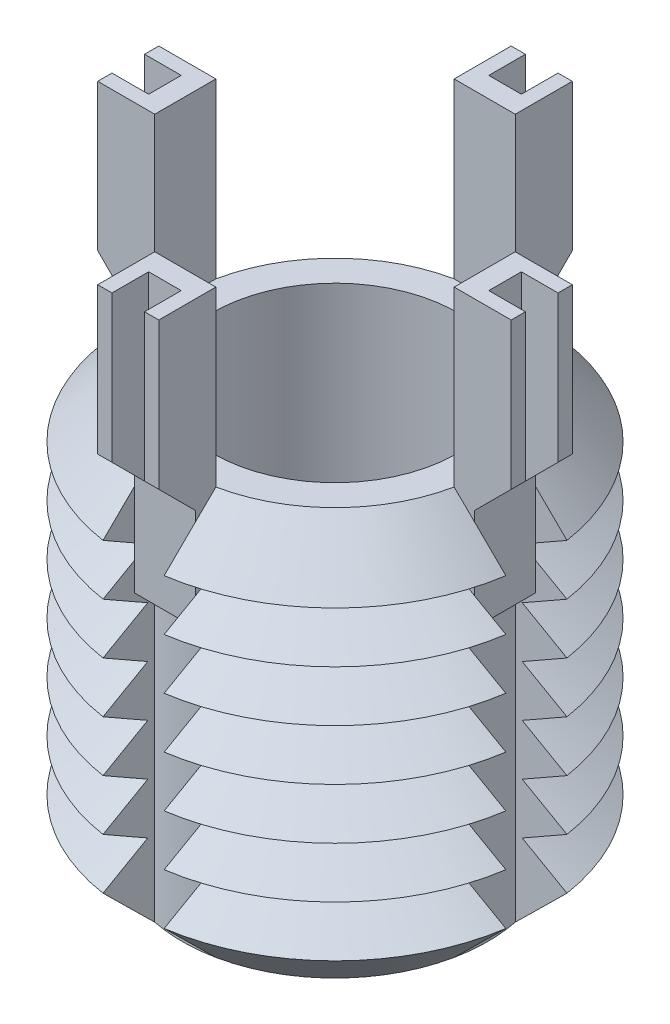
from build123d import *

# Parameters (mm, degrees)
SKETCH1_R               = 5
BOSS_EXTRUDE1_DEPTH     = 10
CHAMFER1_SIZE           = 1.25
LPATTERN1_COUNT         = 6
LPATTERN1_PITCH         = 1.25
CUT_EXTRUDE1_REACH      = 14.247
CIRPATTERN1_COUNT       = 4
BOSS_EXTRUDE3_DEPTH     = 0.75
CIRPATTERN2_COUNT       = 4
CUT_EXTRUDE3_DEPTH      = 16.954880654
CUT_EXTRUDE3_DEPTH_BACK = 16.954880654
SKETCH6_W               = 0.9
SKETCH6_H               = 0.8
SKETCH6_W_2             = 0.8
SKETCH6_H_2             = 0.9
SKETCH7_R               = 3
CUT_EXTRUDE4_DEPTH      = 10


with BuildPart() as part:
    # Sketch1 → Boss-Extrude1 (new body)
    with BuildSketch(Plane(origin=(0, 0, 0), x_dir=(1, 0, 0), z_dir=(0, 1, 0))):
        with Locations(Location((0, 0, 0), (0, 0, 270))):
            Circle(SKETCH1_R)
    extrude(amount=-BOSS_EXTRUDE1_DEPTH)

    # Chamfer1
    chamfer1_edges = [part.edges().sort_by_distance(p)[0] for p in [
        (0, 0, -5),
        (0, -10, -5),
    ]]
    chamfer(chamfer1_edges, length=CHAMFER1_SIZE)

    # Sketch3 → Cut-Revolve1 (revolve, cut)
    with BuildSketch(Plane(origin=(0, 0, 0), x_dir=(0, 0, -1), z_dir=(1, 0, 0))):
        Polygon((-5, -1.25), (-3.917468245, -1.875), (-5, -2.5), align=None)
    cut_revolve1 = revolve(axis=Axis((0, 0.885892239, 0), (0, -1, 0)), mode=Mode.SUBTRACT)

    # LPattern1: Cut-Revolve1 ×6
    with Locations(*[(0, -i * LPATTERN1_PITCH, 0) for i in range(1, LPATTERN1_COUNT)]):
        add(cut_revolve1, mode=Mode.SUBTRACT)

    # Cut-Extrude1: up to this cone (the profile starts inside it)
    cut_extrude1_end = Plane(origin=(0, 0, 0), z_dir=(0, 1, 0)).offset(-13.749999) * Cone(1e-06, 42.247, 42.246999, align=(Align.CENTER, Align.CENTER, Align.MIN), mode=Mode.PRIVATE)
    # Sketch4 → Cut-Extrude1 (cut, up to the surface)
    with BuildSketch(Plane(origin=(0, 0, 0), x_dir=(1, 0, 0), z_dir=(0, 1, 0)), mode=Mode.PRIVATE) as cut_extrude1_sk1:
        with BuildLine():
            Line((-3.674234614, 0.75), (-4.943429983, 0.75))
            ThreePointArc((-4.943429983, 0.75), (-5, 0), (-4.943429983, -0.75))
            Line((-4.943429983, -0.75), (-3.674234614, -0.75))
            ThreePointArc((-3.674234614, -0.75), (-3.75, 0), (-3.674234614, 0.75))
        make_face()
    cut_extrude1_tool1 = extrude(cut_extrude1_sk1.sketch, amount=-CUT_EXTRUDE1_REACH, mode=Mode.PRIVATE) & cut_extrude1_end
    cut_extrude1 = cut_extrude1_tool1.solids().sort_by_distance((-4.352928, 0, 0))[0]
    add(cut_extrude1, mode=Mode.SUBTRACT)

    # CirPattern1: Cut-Extrude1 ×4 about axis
    cirpattern1_axis = Axis((0, 0, 0), (0, 1, 0))
    for i in range(1, CIRPATTERN1_COUNT):
        add(cut_extrude1.rotate(cirpattern1_axis, i * 360 / CIRPATTERN1_COUNT), mode=Mode.SUBTRACT)

    # Sketch5 → Boss-Extrude3 (add, symmetric)
    with BuildSketch(Plane(origin=(0, 0, 0), x_dir=(0, 0, -1), z_dir=(1, 0, 0))):
        Polygon((-3.674234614, 4.25), (-3.674234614, -2.75), (-4.174234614, -2.75), (-4.174234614, -0.25), (-5.074234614, 0.65), (-5.074234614, 4.25), align=None)
    boss_extrude3 = extrude(amount=BOSS_EXTRUDE3_DEPTH, both=True)

    # CirPattern2: Boss-Extrude3 ×4 about axis
    cirpattern2_axis = Axis((0, 0, 0), (0, 1, 0))
    for i in range(1, CIRPATTERN2_COUNT):
        add(boss_extrude3.rotate(cirpattern2_axis, i * 360 / CIRPATTERN2_COUNT))

    # Sketch6 → Cut-Extrude3 (cut, two sides: drawn at the far end of the back side and taken through both)
    with BuildSketch(Plane(origin=(0, 4.25, 0), x_dir=(1, 0, 0), z_dir=(0, 1, 0)).offset(-CUT_EXTRUDE3_DEPTH_BACK)):
        with Locations((-4.624234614, 0)):
            Rectangle(SKETCH6_W, SKETCH6_H)
        with Locations((0, 4.624234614)):
            Rectangle(SKETCH6_W_2, SKETCH6_H_2)
        with Locations((4.624234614, 0)):
            Rectangle(SKETCH6_W, SKETCH6_H)
        with Locations((0, -4.624234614)):
            Rectangle(SKETCH6_W_2, SKETCH6_H_2)
    extrude(amount=CUT_EXTRUDE3_DEPTH + CUT_EXTRUDE3_DEPTH_BACK, mode=Mode.SUBTRACT)

    # Sketch7 → Cut-Extrude4 (cut)
    with BuildSketch(Plane(origin=(0, 0, 0), x_dir=(1, 0, 0), z_dir=(0, 1, 0))):
        with Locations(Location((0, 0, 0), (0, 0, 270))):
            Circle(SKETCH7_R)
    extrude(amount=-CUT_EXTRUDE4_DEPTH, mode=Mode.SUBTRACT)


solid = part.part
